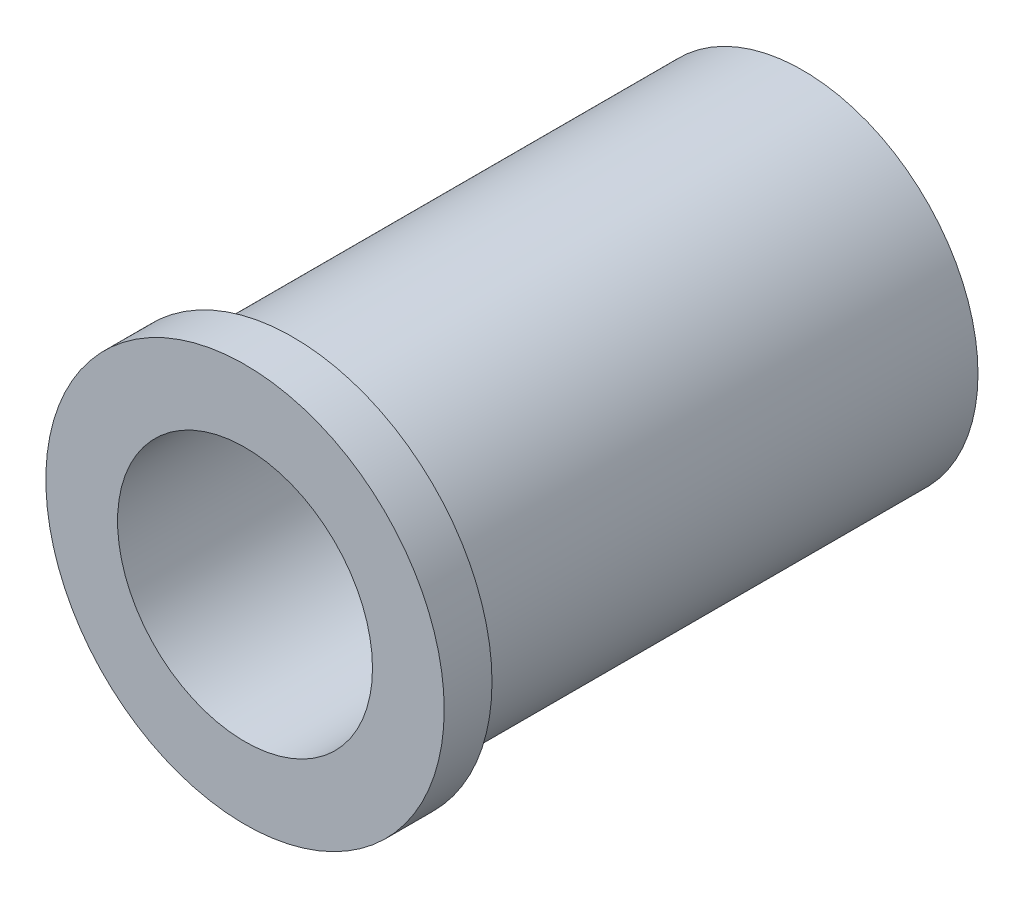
from build123d import *

# Parameters (mm, degrees)
SKETCH_1_R          = 11
EXTRUDE_1_DEPTH     = 32
SKETCH_2_R          = 12.5
EXTRUDE_2_DEPTH     = 3
SKETCH_3_R          = 8
CUT_EXTRUDE_1_DEPTH = 40.210967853


with BuildPart() as part:
    # Sketch 1 → Extrude 1 (new body)
    with BuildSketch(Plane.XY):
        Circle(SKETCH_1_R)
    extrude(amount=EXTRUDE_1_DEPTH)

    # Sketch 2 → Extrude 2 (add)
    with BuildSketch(Plane.XY.offset(32)):
        Circle(SKETCH_2_R)
    extrude(amount=EXTRUDE_2_DEPTH)

    # Sketch 3 → Cut-Extrude 1 (cut, through all)
    with BuildSketch(Plane.XY.offset(35)):
        Circle(SKETCH_3_R)
    extrude(amount=-CUT_EXTRUDE_1_DEPTH, mode=Mode.SUBTRACT)


solid = part.part
